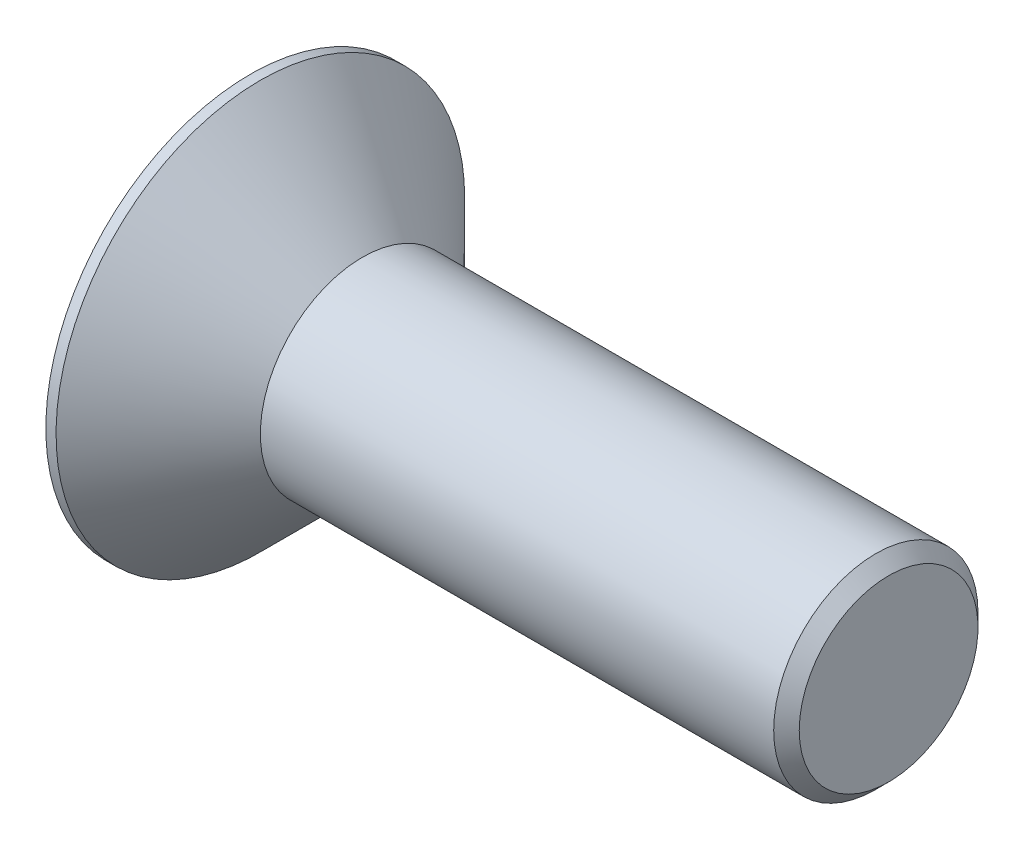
ISO-10303-21;
HEADER;
FILE_DESCRIPTION(('STEP AP214'),'2;1');
FILE_NAME('part.step','',(''),(''),'','','');
FILE_SCHEMA(('AUTOMOTIVE_DESIGN { 1 0 10303 214 1 1 1 1 }'));
ENDSEC;
DATA;
#1=APPLICATION_CONTEXT('core data for automotive mechanical design processes');
#2=APPLICATION_PROTOCOL_DEFINITION('international standard','automotive_design',2000,#1);
#3=PRODUCT_CONTEXT('',#1,'mechanical');
#4=PRODUCT('Part','Part','',(#3));
#5=PRODUCT_RELATED_PRODUCT_CATEGORY('part','',(#4));
#6=PRODUCT_DEFINITION_FORMATION('','',#4);
#7=PRODUCT_DEFINITION_CONTEXT('part definition',#1,'design');
#8=PRODUCT_DEFINITION('design','',#6,#7);
#9=PRODUCT_DEFINITION_SHAPE('','',#8);
#10=(LENGTH_UNIT() NAMED_UNIT(*) SI_UNIT(.MILLI.,.METRE.));
#11=(NAMED_UNIT(*) PLANE_ANGLE_UNIT() SI_UNIT($,.RADIAN.));
#12=(NAMED_UNIT(*) SI_UNIT($,.STERADIAN.) SOLID_ANGLE_UNIT());
#13=UNCERTAINTY_MEASURE_WITH_UNIT(LENGTH_MEASURE(1.E-05),#10,'distance_accuracy_value','');
#14=(GEOMETRIC_REPRESENTATION_CONTEXT(3) GLOBAL_UNCERTAINTY_ASSIGNED_CONTEXT((#13)) GLOBAL_UNIT_ASSIGNED_CONTEXT((#10,
#11,#12)) REPRESENTATION_CONTEXT('',''));
#15=CARTESIAN_POINT('',(0.,0.,0.));
#16=DIRECTION('',(0.,0.,1.));
#17=DIRECTION('',(1.,0.,0.));
#18=AXIS2_PLACEMENT_3D('',#15,#16,#17);
#19=CARTESIAN_POINT('',(13.9489568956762,-1.5364456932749,0.));
#20=DIRECTION('',(1.,0.,0.));
#21=DIRECTION('',(0.,0.,-1.));
#22=AXIS2_PLACEMENT_3D('',#19,#20,#21);
#23=PLANE('',#22);
#24=DIRECTION('',(0.,1.,0.));
#25=VECTOR('',#24,1.);
#26=CARTESIAN_POINT('',(13.9489568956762,-2.97982136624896,2.5));
#27=LINE('',#26,#25);
#28=CARTESIAN_POINT('',(13.9489568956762,-2.97982136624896,2.5));
#29=VERTEX_POINT('',#28);
#30=CARTESIAN_POINT('',(13.9489568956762,-0.0930700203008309,2.5));
#31=VERTEX_POINT('',#30);
#32=EDGE_CURVE('E176',#29,#31,#27,.T.);
#33=ORIENTED_EDGE('',*,*,#32,.T.);
#34=DIRECTION('',(0.,-0.5,0.866025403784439));
#35=VECTOR('',#34,1.);
#36=CARTESIAN_POINT('',(13.9489568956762,-0.093070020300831,2.5));
#37=LINE('',#36,#35);
#38=CARTESIAN_POINT('',(13.9489568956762,1.35030565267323,0.));
#39=VERTEX_POINT('',#38);
#40=EDGE_CURVE('E181',#31,#39,#37,.F.);
#41=ORIENTED_EDGE('',*,*,#40,.T.);
#42=DIRECTION('',(0.,0.500000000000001,0.866025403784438));
#43=VECTOR('',#42,1.);
#44=CARTESIAN_POINT('',(13.9489568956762,1.35030565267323,0.));
#45=LINE('',#44,#43);
#46=CARTESIAN_POINT('',(13.9489568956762,-0.0930700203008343,-2.5));
#47=VERTEX_POINT('',#46);
#48=EDGE_CURVE('E185',#39,#47,#45,.F.);
#49=ORIENTED_EDGE('',*,*,#48,.T.);
#50=DIRECTION('',(0.,1.,0.));
#51=VECTOR('',#50,1.);
#52=CARTESIAN_POINT('',(13.9489568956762,-0.093070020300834,-2.5));
#53=LINE('',#52,#51);
#54=CARTESIAN_POINT('',(13.9489568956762,-2.97982136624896,-2.5));
#55=VERTEX_POINT('',#54);
#56=EDGE_CURVE('E86',#47,#55,#53,.F.);
#57=ORIENTED_EDGE('',*,*,#56,.T.);
#58=DIRECTION('',(0.,0.5,-0.866025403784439));
#59=VECTOR('',#58,1.);
#60=CARTESIAN_POINT('',(13.9489568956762,-2.97982136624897,-2.5));
#61=LINE('',#60,#59);
#62=CARTESIAN_POINT('',(13.9489568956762,-4.42319703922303,0.));
#63=VERTEX_POINT('',#62);
#64=EDGE_CURVE('E88',#55,#63,#61,.F.);
#65=ORIENTED_EDGE('',*,*,#64,.T.);
#66=DIRECTION('',(0.,-0.500000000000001,-0.866025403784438));
#67=VECTOR('',#66,1.);
#68=CARTESIAN_POINT('',(13.9489568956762,-4.42319703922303,0.));
#69=LINE('',#68,#67);
#70=EDGE_CURVE('E90',#63,#29,#69,.F.);
#71=ORIENTED_EDGE('',*,*,#70,.T.);
#72=EDGE_LOOP('',(#33,#41,#49,#57,#65,#71));
#73=FACE_BOUND('',#72,.T.);
#74=ADVANCED_FACE('F17',(#73),#23,.F.);
#75=CARTESIAN_POINT('',(10.4489568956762,-4.42319703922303,0.));
#76=DIRECTION('',(0.,-0.866025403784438,0.500000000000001));
#77=DIRECTION('',(0.,-0.500000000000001,-0.866025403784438));
#78=AXIS2_PLACEMENT_3D('',#75,#76,#77);
#79=PLANE('',#78);
#80=DIRECTION('',(1.,0.,0.));
#81=VECTOR('',#80,1.);
#82=CARTESIAN_POINT('',(10.4489568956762,-2.97982136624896,2.5));
#83=LINE('',#82,#81);
#84=CARTESIAN_POINT('',(10.5489568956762,-2.97982136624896,2.5));
#85=VERTEX_POINT('',#84);
#86=EDGE_CURVE('E101',#85,#29,#83,.T.);
#87=ORIENTED_EDGE('',*,*,#86,.T.);
#88=ORIENTED_EDGE('',*,*,#70,.F.);
#89=DIRECTION('',(1.,0.,0.));
#90=VECTOR('',#89,1.);
#91=CARTESIAN_POINT('',(10.4489568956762,-4.42319703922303,0.));
#92=LINE('',#91,#90);
#93=CARTESIAN_POINT('',(10.5489568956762,-4.42319703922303,0.));
#94=VERTEX_POINT('',#93);
#95=EDGE_CURVE('E95',#63,#94,#92,.F.);
#96=ORIENTED_EDGE('',*,*,#95,.T.);
#97=DIRECTION('',(0.,-0.500000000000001,-0.866025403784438));
#98=VECTOR('',#97,1.);
#99=CARTESIAN_POINT('',(10.5489568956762,-2.97982136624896,2.5));
#100=LINE('',#99,#98);
#101=EDGE_CURVE('E172',#85,#94,#100,.T.);
#102=ORIENTED_EDGE('',*,*,#101,.F.);
#103=EDGE_LOOP('',(#87,#88,#96,#102));
#104=FACE_BOUND('',#103,.T.);
#105=ADVANCED_FACE('F98',(#104),#79,.F.);
#106=CARTESIAN_POINT('',(10.4489568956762,-2.97982136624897,-2.5));
#107=DIRECTION('',(0.,-0.866025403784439,-0.5));
#108=DIRECTION('',(0.,0.5,-0.866025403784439));
#109=AXIS2_PLACEMENT_3D('',#106,#107,#108);
#110=PLANE('',#109);
#111=ORIENTED_EDGE('',*,*,#95,.F.);
#112=ORIENTED_EDGE('',*,*,#64,.F.);
#113=DIRECTION('',(-1.,0.,0.));
#114=VECTOR('',#113,1.);
#115=CARTESIAN_POINT('',(10.4489568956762,-2.97982136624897,-2.5));
#116=LINE('',#115,#114);
#117=CARTESIAN_POINT('',(10.5489568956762,-2.97982136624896,-2.5));
#118=VERTEX_POINT('',#117);
#119=EDGE_CURVE('E109',#55,#118,#116,.T.);
#120=ORIENTED_EDGE('',*,*,#119,.T.);
#121=DIRECTION('',(0.,0.499999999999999,-0.866025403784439));
#122=VECTOR('',#121,1.);
#123=CARTESIAN_POINT('',(10.5489568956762,-4.42319703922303,0.));
#124=LINE('',#123,#122);
#125=EDGE_CURVE('E106',#94,#118,#124,.T.);
#126=ORIENTED_EDGE('',*,*,#125,.F.);
#127=EDGE_LOOP('',(#111,#112,#120,#126));
#128=FACE_BOUND('',#127,.T.);
#129=ADVANCED_FACE('F104',(#128),#110,.F.);
#130=CARTESIAN_POINT('',(10.4489568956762,-0.093070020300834,-2.5));
#131=DIRECTION('',(0.,0.,-1.));
#132=DIRECTION('',(-1.,0.,0.));
#133=AXIS2_PLACEMENT_3D('',#130,#131,#132);
#134=PLANE('',#133);
#135=ORIENTED_EDGE('',*,*,#119,.F.);
#136=ORIENTED_EDGE('',*,*,#56,.F.);
#137=DIRECTION('',(1.,0.,0.));
#138=VECTOR('',#137,1.);
#139=CARTESIAN_POINT('',(10.4489568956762,-0.0930700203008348,-2.5));
#140=LINE('',#139,#138);
#141=CARTESIAN_POINT('',(10.5489568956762,-0.0930700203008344,-2.5));
#142=VERTEX_POINT('',#141);
#143=EDGE_CURVE('E183',#47,#142,#140,.F.);
#144=ORIENTED_EDGE('',*,*,#143,.T.);
#145=DIRECTION('',(0.,1.,0.));
#146=VECTOR('',#145,1.);
#147=CARTESIAN_POINT('',(10.5489568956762,1.18524214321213,-2.5));
#148=LINE('',#147,#146);
#149=EDGE_CURVE('E165',#118,#142,#148,.T.);
#150=ORIENTED_EDGE('',*,*,#149,.F.);
#151=EDGE_LOOP('',(#135,#136,#144,#150));
#152=FACE_BOUND('',#151,.T.);
#153=ADVANCED_FACE('F188',(#152),#134,.F.);
#154=CARTESIAN_POINT('',(10.4489568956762,1.35030565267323,0.));
#155=DIRECTION('',(0.,0.866025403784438,-0.500000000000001));
#156=DIRECTION('',(0.,0.500000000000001,0.866025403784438));
#157=AXIS2_PLACEMENT_3D('',#154,#155,#156);
#158=PLANE('',#157);
#159=ORIENTED_EDGE('',*,*,#143,.F.);
#160=ORIENTED_EDGE('',*,*,#48,.F.);
#161=DIRECTION('',(1.,0.,0.));
#162=VECTOR('',#161,1.);
#163=CARTESIAN_POINT('',(10.4489568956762,1.35030565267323,0.));
#164=LINE('',#163,#162);
#165=CARTESIAN_POINT('',(10.5489568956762,1.35030565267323,0.));
#166=VERTEX_POINT('',#165);
#167=EDGE_CURVE('E179',#39,#166,#164,.F.);
#168=ORIENTED_EDGE('',*,*,#167,.T.);
#169=DIRECTION('',(0.,0.500000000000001,0.866025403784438));
#170=VECTOR('',#169,1.);
#171=CARTESIAN_POINT('',(10.5489568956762,-0.0930700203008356,-2.5));
#172=LINE('',#171,#170);
#173=EDGE_CURVE('E159',#142,#166,#172,.T.);
#174=ORIENTED_EDGE('',*,*,#173,.F.);
#175=EDGE_LOOP('',(#159,#160,#168,#174));
#176=FACE_BOUND('',#175,.T.);
#177=ADVANCED_FACE('F218',(#176),#158,.F.);
#178=CARTESIAN_POINT('',(10.4489568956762,-0.093070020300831,2.5));
#179=DIRECTION('',(0.,0.866025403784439,0.5));
#180=DIRECTION('',(0.,-0.5,0.866025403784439));
#181=AXIS2_PLACEMENT_3D('',#178,#179,#180);
#182=PLANE('',#181);
#183=ORIENTED_EDGE('',*,*,#167,.F.);
#184=ORIENTED_EDGE('',*,*,#40,.F.);
#185=DIRECTION('',(1.,0.,0.));
#186=VECTOR('',#185,1.);
#187=CARTESIAN_POINT('',(10.4489568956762,-0.0930700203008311,2.5));
#188=LINE('',#187,#186);
#189=CARTESIAN_POINT('',(10.5489568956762,-0.0930700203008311,2.5));
#190=VERTEX_POINT('',#189);
#191=EDGE_CURVE('E174',#31,#190,#188,.F.);
#192=ORIENTED_EDGE('',*,*,#191,.T.);
#193=DIRECTION('',(0.,-0.499999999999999,0.866025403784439));
#194=VECTOR('',#193,1.);
#195=CARTESIAN_POINT('',(10.5489568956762,1.35030565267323,0.));
#196=LINE('',#195,#194);
#197=EDGE_CURVE('E154',#166,#190,#196,.T.);
#198=ORIENTED_EDGE('',*,*,#197,.F.);
#199=EDGE_LOOP('',(#183,#184,#192,#198));
#200=FACE_BOUND('',#199,.T.);
#201=ADVANCED_FACE('F213',(#200),#182,.F.);
#202=CARTESIAN_POINT('',(10.4489568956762,-2.97982136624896,2.5));
#203=DIRECTION('',(0.,0.,1.));
#204=DIRECTION('',(1.,0.,0.));
#205=AXIS2_PLACEMENT_3D('',#202,#203,#204);
#206=PLANE('',#205);
#207=ORIENTED_EDGE('',*,*,#191,.F.);
#208=ORIENTED_EDGE('',*,*,#32,.F.);
#209=ORIENTED_EDGE('',*,*,#86,.F.);
#210=DIRECTION('',(0.,1.,0.));
#211=VECTOR('',#210,1.);
#212=CARTESIAN_POINT('',(10.5489568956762,-0.258133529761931,2.5));
#213=LINE('',#212,#211);
#214=EDGE_CURVE('E148',#190,#85,#213,.F.);
#215=ORIENTED_EDGE('',*,*,#214,.F.);
#216=EDGE_LOOP('',(#207,#208,#209,#215));
#217=FACE_BOUND('',#216,.T.);
#218=ADVANCED_FACE('F208',(#217),#206,.F.);
#219=CARTESIAN_POINT('',(10.4989568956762,-3.60565439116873,1.51602540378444));
#220=DIRECTION('',(-0.70710678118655,0.612372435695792,-0.353553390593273));
#221=DIRECTION('',(-0.654653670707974,-0.755928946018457,0.));
#222=AXIS2_PLACEMENT_3D('',#219,#220,#221);
#223=PLANE('',#222);
#224=DIRECTION('',(0.,-0.500000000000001,-0.866025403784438));
#225=VECTOR('',#224,1.);
#226=CARTESIAN_POINT('',(10.4489568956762,-3.03755639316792,2.6));
#227=LINE('',#226,#225);
#228=CARTESIAN_POINT('',(10.4489568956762,-3.03755639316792,2.6));
#229=VERTEX_POINT('',#228);
#230=CARTESIAN_POINT('',(10.4489568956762,-4.53866709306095,0.));
#231=VERTEX_POINT('',#230);
#232=EDGE_CURVE('E142',#229,#231,#227,.T.);
#233=ORIENTED_EDGE('',*,*,#232,.F.);
#234=DIRECTION('',(-0.654653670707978,-0.377964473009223,0.654653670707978));
#235=VECTOR('',#234,1.);
#236=CARTESIAN_POINT('',(10.5489568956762,-2.97982136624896,2.5));
#237=LINE('',#236,#235);
#238=EDGE_CURVE('E145',#85,#229,#237,.T.);
#239=ORIENTED_EDGE('',*,*,#238,.F.);
#240=ORIENTED_EDGE('',*,*,#101,.T.);
#241=DIRECTION('',(-0.654653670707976,-0.755928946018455,0.));
#242=VECTOR('',#241,1.);
#243=CARTESIAN_POINT('',(11.289249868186,-3.56838034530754,0.));
#244=LINE('',#243,#242);
#245=EDGE_CURVE('E168',#231,#94,#244,.F.);
#246=ORIENTED_EDGE('',*,*,#245,.F.);
#247=EDGE_LOOP('',(#233,#239,#240,#246));
#248=FACE_BOUND('',#247,.T.);
#249=ADVANCED_FACE('F202',(#248),#223,.T.);
#250=CARTESIAN_POINT('',(10.4989568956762,-2.8839665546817,-2.76602540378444));
#251=DIRECTION('',(-0.707106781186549,0.612372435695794,0.353553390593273));
#252=DIRECTION('',(-0.654653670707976,-0.755928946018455,0.));
#253=AXIS2_PLACEMENT_3D('',#250,#251,#252);
#254=PLANE('',#253);
#255=DIRECTION('',(0.,0.499999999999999,-0.866025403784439));
#256=VECTOR('',#255,1.);
#257=CARTESIAN_POINT('',(10.4489568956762,-4.53866709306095,0.));
#258=LINE('',#257,#256);
#259=CARTESIAN_POINT('',(10.4489568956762,-3.03755639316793,-2.6));
#260=VERTEX_POINT('',#259);
#261=EDGE_CURVE('E139',#231,#260,#258,.T.);
#262=ORIENTED_EDGE('',*,*,#261,.F.);
#263=ORIENTED_EDGE('',*,*,#245,.T.);
#264=ORIENTED_EDGE('',*,*,#125,.T.);
#265=DIRECTION('',(0.654653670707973,0.377964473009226,0.654653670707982));
#266=VECTOR('',#265,1.);
#267=CARTESIAN_POINT('',(10.4489568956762,-3.03755639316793,-2.6));
#268=LINE('',#267,#266);
#269=EDGE_CURVE('E162',#260,#118,#268,.T.);
#270=ORIENTED_EDGE('',*,*,#269,.F.);
#271=EDGE_LOOP('',(#262,#263,#264,#270));
#272=FACE_BOUND('',#271,.T.);
#273=ADVANCED_FACE('F194',(#272),#254,.T.);
#274=CARTESIAN_POINT('',(10.4989568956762,1.18524214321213,-2.55));
#275=DIRECTION('',(-0.707106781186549,0.,0.707106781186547));
#276=DIRECTION('',(0.707106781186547,0.,0.707106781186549));
#277=AXIS2_PLACEMENT_3D('',#274,#275,#276);
#278=PLANE('',#277);
#279=DIRECTION('',(0.,1.,0.));
#280=VECTOR('',#279,1.);
#281=CARTESIAN_POINT('',(10.4489568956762,2.4635543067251,-2.6));
#282=LINE('',#281,#280);
#283=CARTESIAN_POINT('',(10.4489568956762,-0.035334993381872,-2.6));
#284=VERTEX_POINT('',#283);
#285=EDGE_CURVE('E136',#260,#284,#282,.T.);
#286=ORIENTED_EDGE('',*,*,#285,.F.);
#287=ORIENTED_EDGE('',*,*,#269,.T.);
#288=ORIENTED_EDGE('',*,*,#149,.T.);
#289=DIRECTION('',(0.654653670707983,-0.377964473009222,0.654653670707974));
#290=VECTOR('',#289,1.);
#291=CARTESIAN_POINT('',(10.4489568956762,-0.0353349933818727,-2.6));
#292=LINE('',#291,#290);
#293=EDGE_CURVE('E156',#284,#142,#292,.T.);
#294=ORIENTED_EDGE('',*,*,#293,.F.);
#295=EDGE_LOOP('',(#286,#287,#288,#294));
#296=FACE_BOUND('',#295,.T.);
#297=ADVANCED_FACE('F196',(#296),#278,.T.);
#298=CARTESIAN_POINT('',(10.4989568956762,1.53276300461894,0.216025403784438));
#299=DIRECTION('',(-0.707106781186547,-0.612372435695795,0.353553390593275));
#300=DIRECTION('',(0.654653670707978,-0.755928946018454,0.));
#301=AXIS2_PLACEMENT_3D('',#298,#299,#300);
#302=PLANE('',#301);
#303=DIRECTION('',(0.,0.500000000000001,0.866025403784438));
#304=VECTOR('',#303,1.);
#305=CARTESIAN_POINT('',(10.4489568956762,-0.0353349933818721,-2.6));
#306=LINE('',#305,#304);
#307=CARTESIAN_POINT('',(10.4489568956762,1.46577570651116,0.));
#308=VERTEX_POINT('',#307);
#309=EDGE_CURVE('E129',#284,#308,#306,.T.);
#310=ORIENTED_EDGE('',*,*,#309,.F.);
#311=ORIENTED_EDGE('',*,*,#293,.T.);
#312=ORIENTED_EDGE('',*,*,#173,.T.);
#313=DIRECTION('',(0.654653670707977,-0.755928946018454,0.));
#314=VECTOR('',#313,1.);
#315=CARTESIAN_POINT('',(10.7943782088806,1.06691753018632,0.));
#316=LINE('',#315,#314);
#317=EDGE_CURVE('E151',#308,#166,#316,.T.);
#318=ORIENTED_EDGE('',*,*,#317,.F.);
#319=EDGE_LOOP('',(#310,#311,#312,#318));
#320=FACE_BOUND('',#319,.T.);
#321=ADVANCED_FACE('F216',(#320),#302,.T.);
#322=CARTESIAN_POINT('',(10.4989568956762,0.811075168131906,1.03397459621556));
#323=DIRECTION('',(-0.707106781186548,-0.612372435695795,-0.353553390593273));
#324=DIRECTION('',(0.654653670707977,-0.755928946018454,0.));
#325=AXIS2_PLACEMENT_3D('',#322,#323,#324);
#326=PLANE('',#325);
#327=DIRECTION('',(0.,-0.499999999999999,0.866025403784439));
#328=VECTOR('',#327,1.);
#329=CARTESIAN_POINT('',(10.4489568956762,1.46577570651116,0.));
#330=LINE('',#329,#328);
#331=CARTESIAN_POINT('',(10.4489568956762,-0.0353349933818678,2.6));
#332=VERTEX_POINT('',#331);
#333=EDGE_CURVE('E124',#308,#332,#330,.T.);
#334=ORIENTED_EDGE('',*,*,#333,.F.);
#335=ORIENTED_EDGE('',*,*,#317,.T.);
#336=ORIENTED_EDGE('',*,*,#197,.T.);
#337=DIRECTION('',(0.654653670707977,-0.377964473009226,-0.654653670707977));
#338=VECTOR('',#337,1.);
#339=CARTESIAN_POINT('',(10.4489568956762,-0.0353349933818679,2.6));
#340=LINE('',#339,#338);
#341=EDGE_CURVE('E35',#332,#190,#340,.T.);
#342=ORIENTED_EDGE('',*,*,#341,.F.);
#343=EDGE_LOOP('',(#334,#335,#336,#342));
#344=FACE_BOUND('',#343,.T.);
#345=ADVANCED_FACE('F210',(#344),#326,.T.);
#346=CARTESIAN_POINT('',(10.4989568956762,-0.258133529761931,2.55));
#347=DIRECTION('',(-0.707106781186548,0.,-0.707106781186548));
#348=DIRECTION('',(-0.707106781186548,0.,0.707106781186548));
#349=AXIS2_PLACEMENT_3D('',#346,#347,#348);
#350=PLANE('',#349);
#351=DIRECTION('',(0.,1.,0.));
#352=VECTOR('',#351,1.);
#353=CARTESIAN_POINT('',(10.4489568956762,2.4635543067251,2.6));
#354=LINE('',#353,#352);
#355=EDGE_CURVE('E120',#332,#229,#354,.F.);
#356=ORIENTED_EDGE('',*,*,#355,.F.);
#357=ORIENTED_EDGE('',*,*,#341,.T.);
#358=ORIENTED_EDGE('',*,*,#214,.T.);
#359=ORIENTED_EDGE('',*,*,#238,.T.);
#360=EDGE_LOOP('',(#356,#357,#358,#359));
#361=FACE_BOUND('',#360,.T.);
#362=ADVANCED_FACE('F204',(#361),#350,.T.);
#363=CARTESIAN_POINT('',(10.4489568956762,2.4635543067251,0.));
#364=DIRECTION('',(-1.,0.,0.));
#365=DIRECTION('',(0.,0.,1.));
#366=AXIS2_PLACEMENT_3D('',#363,#364,#365);
#367=PLANE('',#366);
#368=ORIENTED_EDGE('',*,*,#333,.T.);
#369=ORIENTED_EDGE('',*,*,#355,.T.);
#370=ORIENTED_EDGE('',*,*,#232,.T.);
#371=ORIENTED_EDGE('',*,*,#261,.T.);
#372=ORIENTED_EDGE('',*,*,#285,.T.);
#373=ORIENTED_EDGE('',*,*,#309,.T.);
#374=EDGE_LOOP('',(#368,#369,#370,#371,#372,#373));
#375=FACE_BOUND('',#374,.T.);
#376=CARTESIAN_POINT('',(10.4489568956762,-1.5364456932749,0.));
#377=DIRECTION('',(1.,0.,0.));
#378=DIRECTION('',(0.,0.,-1.));
#379=AXIS2_PLACEMENT_3D('',#376,#377,#378);
#380=CIRCLE('',#379,8.);
#381=CARTESIAN_POINT('',(10.4489568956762,-1.5364456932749,-8.));
#382=VERTEX_POINT('',#381);
#383=EDGE_CURVE('E20',#382,#382,#380,.T.);
#384=ORIENTED_EDGE('',*,*,#383,.F.);
#385=EDGE_LOOP('',(#384));
#386=FACE_BOUND('',#385,.T.);
#387=ADVANCED_FACE('F198',(#375,#386),#367,.T.);
#388=CARTESIAN_POINT('',(35.4489568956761,0.213554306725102,0.));
#389=DIRECTION('',(1.,0.,0.));
#390=DIRECTION('',(0.,0.,-1.));
#391=AXIS2_PLACEMENT_3D('',#388,#389,#390);
#392=PLANE('',#391);
#393=CARTESIAN_POINT('',(35.4489568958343,-1.5364456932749,0.));
#394=DIRECTION('',(-1.,0.,0.));
#395=DIRECTION('',(0.,0.,1.));
#396=AXIS2_PLACEMENT_3D('',#393,#394,#395);
#397=CIRCLE('',#396,3.50000000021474);
#398=CARTESIAN_POINT('',(35.4489568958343,-1.5364456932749,3.50000000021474));
#399=VERTEX_POINT('',#398);
#400=EDGE_CURVE('E112',#399,#399,#397,.T.);
#401=ORIENTED_EDGE('',*,*,#400,.F.);
#402=EDGE_LOOP('',(#401));
#403=FACE_BOUND('',#402,.T.);
#404=ADVANCED_FACE('F248',(#403),#392,.T.);
#405=CARTESIAN_POINT('',(10.6489568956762,-1.5364456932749,0.));
#406=DIRECTION('',(1.,0.,0.));
#407=DIRECTION('',(0.,0.,-1.));
#408=AXIS2_PLACEMENT_3D('',#405,#406,#407);
#409=CYLINDRICAL_SURFACE('',#408,8.);
#410=ORIENTED_EDGE('',*,*,#383,.T.);
#411=EDGE_LOOP('',(#410));
#412=FACE_BOUND('',#411,.T.);
#413=CARTESIAN_POINT('',(10.8489568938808,-1.5364456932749,0.));
#414=DIRECTION('',(-1.,0.,0.));
#415=DIRECTION('',(0.,1.,0.));
#416=AXIS2_PLACEMENT_3D('',#413,#414,#415);
#417=CIRCLE('',#416,7.9999999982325);
#418=CARTESIAN_POINT('',(10.8489568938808,6.4635543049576,0.));
#419=VERTEX_POINT('',#418);
#420=EDGE_CURVE('E114',#419,#419,#417,.F.);
#421=ORIENTED_EDGE('',*,*,#420,.F.);
#422=EDGE_LOOP('',(#421));
#423=FACE_BOUND('',#422,.T.);
#424=ADVANCED_FACE('F244',(#412,#423),#409,.T.);
#425=CARTESIAN_POINT('',(34.9489568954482,-1.5364456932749,0.));
#426=DIRECTION('',(-1.,0.,0.));
#427=DIRECTION('',(0.,0.,1.));
#428=AXIS2_PLACEMENT_3D('',#425,#426,#427);
#429=CONICAL_SURFACE('',#428,3.99999999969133,0.785398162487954);
#430=CARTESIAN_POINT('',(34.9489568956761,-1.5364456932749,0.));
#431=DIRECTION('',(1.,0.,0.));
#432=DIRECTION('',(0.,0.,-1.));
#433=AXIS2_PLACEMENT_3D('',#430,#431,#432);
#434=CIRCLE('',#433,4.);
#435=CARTESIAN_POINT('',(34.9489568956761,-1.5364456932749,-4.));
#436=VERTEX_POINT('',#435);
#437=EDGE_CURVE('E26',#436,#436,#434,.F.);
#438=ORIENTED_EDGE('',*,*,#437,.F.);
#439=EDGE_LOOP('',(#438));
#440=FACE_BOUND('',#439,.T.);
#441=ORIENTED_EDGE('',*,*,#400,.T.);
#442=EDGE_LOOP('',(#441));
#443=FACE_BOUND('',#442,.T.);
#444=ADVANCED_FACE('F237',(#440,#443),#429,.T.);
#445=CARTESIAN_POINT('',(10.8489568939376,-1.5364456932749,0.));
#446=DIRECTION('',(-1.,0.,0.));
#447=DIRECTION('',(0.,0.,1.));
#448=AXIS2_PLACEMENT_3D('',#445,#446,#447);
#449=CONICAL_SURFACE('',#448,7.99999999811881,0.785398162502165);
#450=ORIENTED_EDGE('',*,*,#420,.T.);
#451=EDGE_LOOP('',(#450));
#452=FACE_BOUND('',#451,.T.);
#453=CARTESIAN_POINT('',(14.8489568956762,-1.5364456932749,0.));
#454=DIRECTION('',(1.,0.,0.));
#455=DIRECTION('',(0.,0.,-1.));
#456=AXIS2_PLACEMENT_3D('',#453,#454,#455);
#457=CIRCLE('',#456,4.);
#458=CARTESIAN_POINT('',(14.8489568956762,-1.5364456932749,-4.));
#459=VERTEX_POINT('',#458);
#460=EDGE_CURVE('E11',#459,#459,#457,.T.);
#461=ORIENTED_EDGE('',*,*,#460,.F.);
#462=EDGE_LOOP('',(#461));
#463=FACE_BOUND('',#462,.T.);
#464=ADVANCED_FACE('F231',(#452,#463),#449,.T.);
#465=CARTESIAN_POINT('',(24.8989568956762,-1.5364456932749,0.));
#466=DIRECTION('',(1.,0.,0.));
#467=DIRECTION('',(0.,0.,-1.));
#468=AXIS2_PLACEMENT_3D('',#465,#466,#467);
#469=CYLINDRICAL_SURFACE('',#468,4.);
#470=ORIENTED_EDGE('',*,*,#460,.T.);
#471=EDGE_LOOP('',(#470));
#472=FACE_BOUND('',#471,.T.);
#473=ORIENTED_EDGE('',*,*,#437,.T.);
#474=EDGE_LOOP('',(#473));
#475=FACE_BOUND('',#474,.T.);
#476=ADVANCED_FACE('F229',(#472,#475),#469,.T.);
#477=CLOSED_SHELL('',(#74,#105,#129,#153,#177,#201,#218,#249,#273,#297,#321,#345,#362,#387,#404,
#424,#444,#464,#476));
#478=MANIFOLD_SOLID_BREP('B1',#477);
#479=ADVANCED_BREP_SHAPE_REPRESENTATION('',(#18,#478),#14);
#480=SHAPE_DEFINITION_REPRESENTATION(#9,#479);
ENDSEC;
END-ISO-10303-21;
